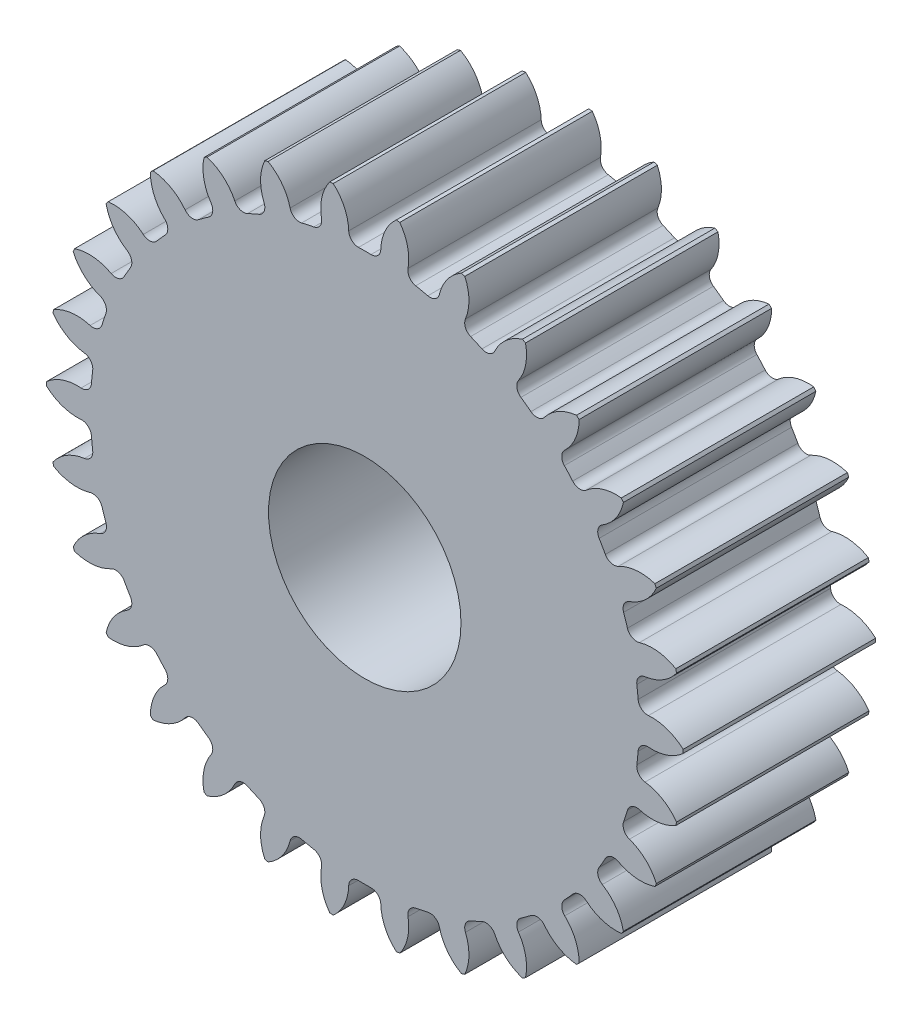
from build123d import *

# Parameters (mm, degrees)
SKETCH1_R                = 6.61650035
SKETCH1_R_2              = 2
BOSS_EXTRUDE1_DEPTH      = 4
CUT_EXTRUDE1_START       = -13
CUT_EXTRUDE1_DEPTH       = 13
FILLET3_R                = 0.2
CIRPATTERN5_COUNT        = 30
FILLET3_OF_CIRPATTERN5_R = 0.2


with BuildPart() as part:
    # Sketch1 → Boss-Extrude1 (new body)
    with BuildSketch(Plane.XY):
        Circle(SKETCH1_R)
        Circle(SKETCH1_R_2, mode=Mode.SUBTRACT)
    extrude(amount=BOSS_EXTRUDE1_DEPTH)

    # Sketch2 → Cut-Extrude1 (cut)
    with BuildSketch(Plane.XY.offset(4).offset(CUT_EXTRUDE1_START)):
        with BuildLine():
            ThreePointArc((0.349893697, 5.688800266), (0, 5.699550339), (-0.349893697, 5.688800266))
            ThreePointArc((-0.349893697, 5.688800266), (-0.384715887, 6.176524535), (-0.654995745, 6.584000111))
            ThreePointArc((-0.654995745, 6.584000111), (0, 6.61650035), (0.654995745, 6.584000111))
            ThreePointArc((0.654995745, 6.584000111), (0.384715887, 6.176524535), (0.349893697, 5.688800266))
        make_face()
    cut_extrude1 = extrude(amount=CUT_EXTRUDE1_DEPTH, mode=Mode.SUBTRACT)

    # Fillet3
    fillet3_edges = [part.edges().sort_by_distance(p)[0] for p in [
        (0.349893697, 5.688800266, 2),
        (-0.349893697, 5.688800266, 2),
    ]]
    fillet(fillet3_edges, radius=FILLET3_R)

    # CirPattern5: Cut-Extrude1 ×30 about axis
    cirpattern5_axis = Axis((0, 0, 0), (0, 0, 1))
    for i in range(1, CIRPATTERN5_COUNT):
        add(cut_extrude1.rotate(cirpattern5_axis, i * 360 / CIRPATTERN5_COUNT), mode=Mode.SUBTRACT)

    # Fillet3 of CirPattern5
    fillet3_of_cirpattern5_edges = [part.edges().sort_by_distance(p)[0] for p in [
        (-0.840520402, 5.637233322, 2),
        (-1.525015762, 5.491739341, 2),
        (-1.994199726, 5.33929223, 2),
        (-2.633487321, 5.054663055, 2),
        (-3.060722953, 4.807998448, 2),
        (-3.626862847, 4.396673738, 2),
        (-3.993477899, 4.066572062, 2),
        (-4.461727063, 3.546528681, 2),
        (-4.751698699, 3.147416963, 2),
        (-5.101592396, 2.541383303, 2),
        (-5.302247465, 2.09070464, 2),
        (-5.518493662, 1.425167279, 2),
        (-5.621062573, 0.942618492, 2),
        (-5.694210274, 0.246664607, 2),
        (-5.694210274, -0.246664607, 2),
        (-5.621062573, -0.942618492, 2),
        (-5.518493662, -1.425167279, 2),
        (-5.302247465, -2.09070464, 2),
        (-5.101592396, -2.541383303, 2),
        (-4.751698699, -3.147416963, 2),
        (-4.461727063, -3.546528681, 2),
        (-3.993477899, -4.066572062, 2),
        (-3.626862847, -4.396673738, 2),
        (-3.060722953, -4.807998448, 2),
        (-2.633487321, -5.054663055, 2),
        (-1.994199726, -5.33929223, 2),
        (-1.525015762, -5.491739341, 2),
        (-0.840520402, -5.637233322, 2),
        (-0.349893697, -5.688800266, 2),
        (0.349893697, -5.688800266, 2),
        (0.840520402, -5.637233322, 2),
        (1.525015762, -5.491739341, 2),
        (1.994199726, -5.33929223, 2),
        (2.633487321, -5.054663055, 2),
        (3.060722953, -4.807998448, 2),
        (3.626862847, -4.396673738, 2),
        (3.993477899, -4.066572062, 2),
        (4.461727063, -3.546528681, 2),
        (4.751698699, -3.147416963, 2),
        (5.101592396, -2.541383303, 2),
        (5.302247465, -2.09070464, 2),
        (5.518493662, -1.425167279, 2),
        (5.621062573, -0.942618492, 2),
        (5.694210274, -0.246664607, 2),
        (5.694210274, 0.246664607, 2),
        (5.621062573, 0.942618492, 2),
        (5.518493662, 1.425167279, 2),
        (5.302247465, 2.09070464, 2),
        (5.101592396, 2.541383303, 2),
        (4.751698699, 3.147416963, 2),
        (4.461727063, 3.546528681, 2),
        (3.993477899, 4.066572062, 2),
        (3.626862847, 4.396673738, 2),
        (3.060722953, 4.807998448, 2),
        (2.633487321, 5.054663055, 2),
        (1.994199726, 5.33929223, 2),
        (1.525015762, 5.491739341, 2),
        (0.840520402, 5.637233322, 2),
    ]]
    fillet(fillet3_of_cirpattern5_edges, radius=FILLET3_OF_CIRPATTERN5_R)


solid = part.part
